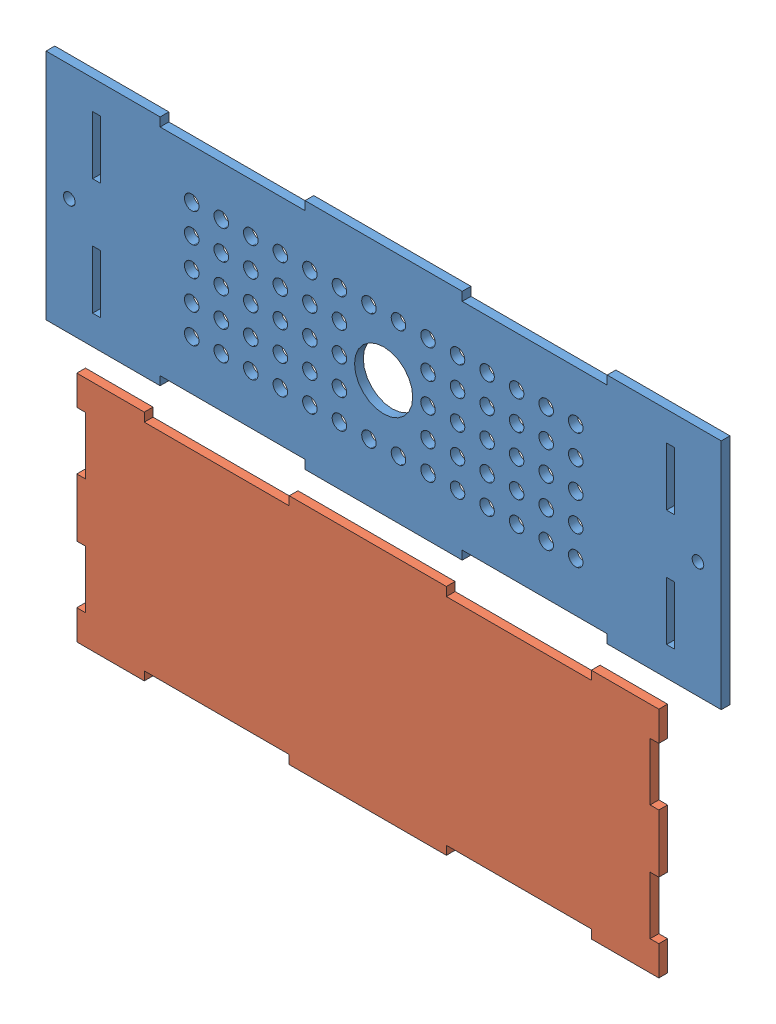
SolidWorks assembly Assem2.sldasm, configuration Default (file format 9000). Lengths in mm.
Overall size (232 169.05 4.5).
2 component instances, 2 part files, 0 mates.
Components (placement in the parent):
- dispenser_stand-1: dispenser_stand.SLDPRT [Default] at (-159.9793 74.8742 273.5) x (1 0 0) z (0 -1 0) size (232 3 80)
- dispenser_stand.p2-1: dispenser_stand.p2.SLDPRT [Default] at (52.076 -94.1782 275) x (-1 0 0) z (0 1 0) size (200 3 80)
